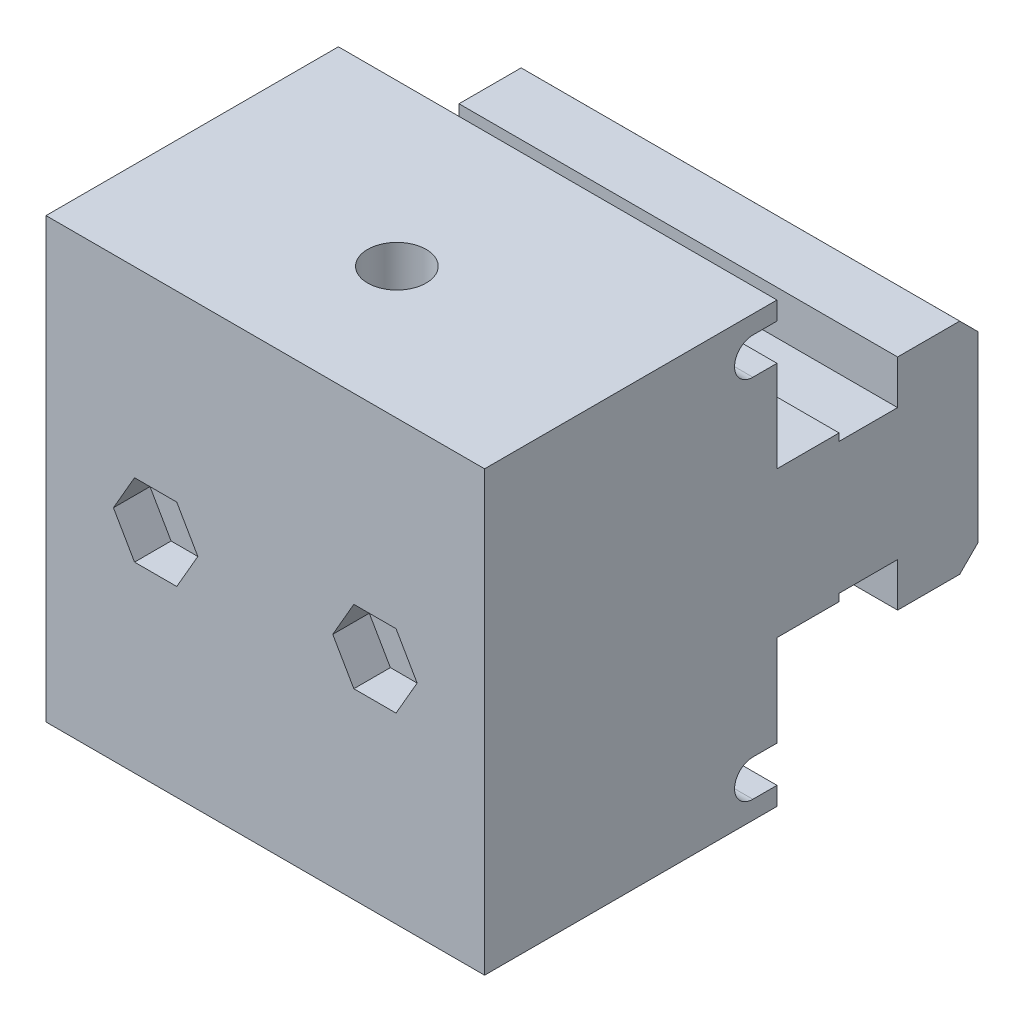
ISO-10303-21;
HEADER;
FILE_DESCRIPTION(('STEP AP214'),'2;1');
FILE_NAME('part.step','',(''),(''),'','','');
FILE_SCHEMA(('AUTOMOTIVE_DESIGN { 1 0 10303 214 1 1 1 1 }'));
ENDSEC;
DATA;
#1=APPLICATION_CONTEXT('core data for automotive mechanical design processes');
#2=APPLICATION_PROTOCOL_DEFINITION('international standard','automotive_design',2000,#1);
#3=PRODUCT_CONTEXT('',#1,'mechanical');
#4=PRODUCT('Part','Part','',(#3));
#5=PRODUCT_RELATED_PRODUCT_CATEGORY('part','',(#4));
#6=PRODUCT_DEFINITION_FORMATION('','',#4);
#7=PRODUCT_DEFINITION_CONTEXT('part definition',#1,'design');
#8=PRODUCT_DEFINITION('design','',#6,#7);
#9=PRODUCT_DEFINITION_SHAPE('','',#8);
#10=(LENGTH_UNIT() NAMED_UNIT(*) SI_UNIT(.MILLI.,.METRE.));
#11=(NAMED_UNIT(*) PLANE_ANGLE_UNIT() SI_UNIT($,.RADIAN.));
#12=(NAMED_UNIT(*) SI_UNIT($,.STERADIAN.) SOLID_ANGLE_UNIT());
#13=UNCERTAINTY_MEASURE_WITH_UNIT(LENGTH_MEASURE(1.E-05),#10,'distance_accuracy_value','');
#14=(GEOMETRIC_REPRESENTATION_CONTEXT(3) GLOBAL_UNCERTAINTY_ASSIGNED_CONTEXT((#13)) GLOBAL_UNIT_ASSIGNED_CONTEXT((#10,
#11,#12)) REPRESENTATION_CONTEXT('',''));
#15=CARTESIAN_POINT('',(0.,0.,0.));
#16=DIRECTION('',(0.,0.,1.));
#17=DIRECTION('',(1.,0.,0.));
#18=AXIS2_PLACEMENT_3D('',#15,#16,#17);
#19=CARTESIAN_POINT('',(60.,9.99922625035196,0.));
#20=DIRECTION('',(0.,0.,1.));
#21=DIRECTION('',(0.,-1.,0.));
#22=AXIS2_PLACEMENT_3D('',#19,#20,#21);
#23=PLANE('',#22);
#24=DIRECTION('',(0.,1.,0.));
#25=VECTOR('',#24,1.);
#26=CARTESIAN_POINT('',(60.,9.99922625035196,0.));
#27=LINE('',#26,#25);
#28=CARTESIAN_POINT('',(60.,27.4990625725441,0.));
#29=VERTEX_POINT('',#28);
#30=CARTESIAN_POINT('',(60.,30.0000595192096,0.));
#31=VERTEX_POINT('',#30);
#32=EDGE_CURVE('E495',#29,#31,#27,.T.);
#33=ORIENTED_EDGE('',*,*,#32,.F.);
#34=DIRECTION('',(1.,0.,0.));
#35=VECTOR('',#34,1.);
#36=CARTESIAN_POINT('',(0.,27.4990625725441,0.));
#37=LINE('',#36,#35);
#38=CARTESIAN_POINT('',(0.,27.4990625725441,0.));
#39=VERTEX_POINT('',#38);
#40=EDGE_CURVE('E291',#39,#29,#37,.T.);
#41=ORIENTED_EDGE('',*,*,#40,.F.);
#42=DIRECTION('',(0.,1.,0.));
#43=VECTOR('',#42,1.);
#44=CARTESIAN_POINT('',(0.,9.99922625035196,0.));
#45=LINE('',#44,#43);
#46=CARTESIAN_POINT('',(0.,30.0000595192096,0.));
#47=VERTEX_POINT('',#46);
#48=EDGE_CURVE('E455',#39,#47,#45,.T.);
#49=ORIENTED_EDGE('',*,*,#48,.T.);
#50=DIRECTION('',(-1.,0.,0.));
#51=VECTOR('',#50,1.);
#52=CARTESIAN_POINT('',(60.,30.0000595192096,0.));
#53=LINE('',#52,#51);
#54=EDGE_CURVE('E512',#31,#47,#53,.T.);
#55=ORIENTED_EDGE('',*,*,#54,.F.);
#56=EDGE_LOOP('',(#33,#41,#49,#55));
#57=FACE_BOUND('',#56,.T.);
#58=ADVANCED_FACE('F14',(#57),#23,.F.);
#59=CARTESIAN_POINT('',(60.,-30.0000595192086,0.));
#60=DIRECTION('',(0.,0.,1.));
#61=DIRECTION('',(1.,0.,0.));
#62=AXIS2_PLACEMENT_3D('',#59,#60,#61);
#63=PLANE('',#62);
#64=DIRECTION('',(0.,1.,0.));
#65=VECTOR('',#64,1.);
#66=CARTESIAN_POINT('',(60.,-30.0000595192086,0.));
#67=LINE('',#66,#65);
#68=CARTESIAN_POINT('',(60.,-22.5006398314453,0.));
#69=VERTEX_POINT('',#68);
#70=CARTESIAN_POINT('',(60.,-10.0004166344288,0.));
#71=VERTEX_POINT('',#70);
#72=EDGE_CURVE('E465',#69,#71,#67,.T.);
#73=ORIENTED_EDGE('',*,*,#72,.F.);
#74=DIRECTION('',(1.,0.,0.));
#75=VECTOR('',#74,1.);
#76=CARTESIAN_POINT('',(0.,-22.5006398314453,0.));
#77=LINE('',#76,#75);
#78=CARTESIAN_POINT('',(0.,-22.5006398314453,0.));
#79=VERTEX_POINT('',#78);
#80=EDGE_CURVE('E309',#79,#69,#77,.T.);
#81=ORIENTED_EDGE('',*,*,#80,.F.);
#82=DIRECTION('',(0.,1.,0.));
#83=VECTOR('',#82,1.);
#84=CARTESIAN_POINT('',(0.,-30.0000595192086,0.));
#85=LINE('',#84,#83);
#86=CARTESIAN_POINT('',(0.,-10.0004166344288,0.));
#87=VERTEX_POINT('',#86);
#88=EDGE_CURVE('E415',#79,#87,#85,.T.);
#89=ORIENTED_EDGE('',*,*,#88,.T.);
#90=DIRECTION('',(-1.,0.,0.));
#91=VECTOR('',#90,1.);
#92=CARTESIAN_POINT('',(60.,-10.0004166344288,0.));
#93=LINE('',#92,#91);
#94=EDGE_CURVE('E9',#71,#87,#93,.T.);
#95=ORIENTED_EDGE('',*,*,#94,.F.);
#96=EDGE_LOOP('',(#73,#81,#89,#95));
#97=FACE_BOUND('',#96,.T.);
#98=ADVANCED_FACE('F582',(#97),#63,.F.);
#99=CARTESIAN_POINT('',(0.,-30.0000595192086,0.));
#100=VERTEX_POINT('',#99);
#101=CARTESIAN_POINT('',(0.,-27.5002529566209,0.));
#102=VERTEX_POINT('',#101);
#103=EDGE_CURVE('E426',#100,#102,#85,.T.);
#104=ORIENTED_EDGE('',*,*,#103,.T.);
#105=DIRECTION('',(1.,0.,0.));
#106=VECTOR('',#105,1.);
#107=CARTESIAN_POINT('',(0.,-27.5002529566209,0.));
#108=LINE('',#107,#106);
#109=CARTESIAN_POINT('',(60.,-27.5002529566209,0.));
#110=VERTEX_POINT('',#109);
#111=EDGE_CURVE('E312',#102,#110,#108,.T.);
#112=ORIENTED_EDGE('',*,*,#111,.T.);
#113=CARTESIAN_POINT('',(60.,-30.0000595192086,0.));
#114=VERTEX_POINT('',#113);
#115=EDGE_CURVE('E466',#114,#110,#67,.T.);
#116=ORIENTED_EDGE('',*,*,#115,.F.);
#117=DIRECTION('',(-1.,0.,0.));
#118=VECTOR('',#117,1.);
#119=CARTESIAN_POINT('',(60.,-30.0000595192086,0.));
#120=LINE('',#119,#118);
#121=EDGE_CURVE('E503',#114,#100,#120,.T.);
#122=ORIENTED_EDGE('',*,*,#121,.T.);
#123=EDGE_LOOP('',(#104,#112,#116,#122));
#124=FACE_BOUND('',#123,.T.);
#125=ADVANCED_FACE('F16',(#124),#63,.F.);
#126=CARTESIAN_POINT('',(60.,-10.0004166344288,-8.49934231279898));
#127=DIRECTION('',(0.,1.,0.));
#128=DIRECTION('',(-1.,0.,0.));
#129=AXIS2_PLACEMENT_3D('',#126,#127,#128);
#130=PLANE('',#129);
#131=DIRECTION('',(0.,0.,-1.));
#132=VECTOR('',#131,1.);
#133=CARTESIAN_POINT('',(0.,-10.0004166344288,-8.49934231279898));
#134=LINE('',#133,#132);
#135=CARTESIAN_POINT('',(0.,-10.0004166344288,-8.49934231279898));
#136=VERTEX_POINT('',#135);
#137=EDGE_CURVE('E429',#87,#136,#134,.T.);
#138=ORIENTED_EDGE('',*,*,#137,.T.);
#139=DIRECTION('',(-1.,0.,0.));
#140=VECTOR('',#139,1.);
#141=CARTESIAN_POINT('',(60.,-10.0004166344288,-8.49934231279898));
#142=LINE('',#141,#140);
#143=CARTESIAN_POINT('',(60.,-10.0004166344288,-8.49934231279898));
#144=VERTEX_POINT('',#143);
#145=EDGE_CURVE('E22',#144,#136,#142,.T.);
#146=ORIENTED_EDGE('',*,*,#145,.F.);
#147=DIRECTION('',(0.,0.,-1.));
#148=VECTOR('',#147,1.);
#149=CARTESIAN_POINT('',(60.,-10.0004166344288,-8.49934231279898));
#150=LINE('',#149,#148);
#151=EDGE_CURVE('E469',#71,#144,#150,.T.);
#152=ORIENTED_EDGE('',*,*,#151,.F.);
#153=ORIENTED_EDGE('',*,*,#94,.T.);
#154=EDGE_LOOP('',(#138,#146,#152,#153));
#155=FACE_BOUND('',#154,.T.);
#156=ADVANCED_FACE('F580',(#155),#130,.F.);
#157=CARTESIAN_POINT('',(60.,-9.00049400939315,-8.49934231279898));
#158=DIRECTION('',(0.,0.,1.));
#159=DIRECTION('',(1.,0.,0.));
#160=AXIS2_PLACEMENT_3D('',#157,#158,#159);
#161=PLANE('',#160);
#162=DIRECTION('',(0.,1.,0.));
#163=VECTOR('',#162,1.);
#164=CARTESIAN_POINT('',(0.,-9.00049400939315,-8.49934231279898));
#165=LINE('',#164,#163);
#166=CARTESIAN_POINT('',(0.,-9.00049400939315,-8.49934231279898));
#167=VERTEX_POINT('',#166);
#168=EDGE_CURVE('E431',#136,#167,#165,.T.);
#169=ORIENTED_EDGE('',*,*,#168,.T.);
#170=DIRECTION('',(-1.,0.,0.));
#171=VECTOR('',#170,1.);
#172=CARTESIAN_POINT('',(60.,-9.00049400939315,-8.49934231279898));
#173=LINE('',#172,#171);
#174=CARTESIAN_POINT('',(60.,-9.00049400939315,-8.49934231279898));
#175=VERTEX_POINT('',#174);
#176=EDGE_CURVE('E548',#175,#167,#173,.T.);
#177=ORIENTED_EDGE('',*,*,#176,.F.);
#178=DIRECTION('',(0.,1.,0.));
#179=VECTOR('',#178,1.);
#180=CARTESIAN_POINT('',(60.,-9.00049400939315,-8.49934231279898));
#181=LINE('',#180,#179);
#182=EDGE_CURVE('E471',#144,#175,#181,.T.);
#183=ORIENTED_EDGE('',*,*,#182,.F.);
#184=ORIENTED_EDGE('',*,*,#145,.T.);
#185=EDGE_LOOP('',(#169,#177,#183,#184));
#186=FACE_BOUND('',#185,.T.);
#187=ADVANCED_FACE('F555',(#186),#161,.F.);
#188=CARTESIAN_POINT('',(60.,-9.00049400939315,-8.49934231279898));
#189=DIRECTION('',(0.,1.,0.));
#190=DIRECTION('',(-1.,0.,0.));
#191=AXIS2_PLACEMENT_3D('',#188,#189,#190);
#192=PLANE('',#191);
#193=DIRECTION('',(0.,0.,-1.));
#194=VECTOR('',#193,1.);
#195=CARTESIAN_POINT('',(0.,-9.00049400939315,-8.49934231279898));
#196=LINE('',#195,#194);
#197=CARTESIAN_POINT('',(0.,-9.00049400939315,-16.4999136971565));
#198=VERTEX_POINT('',#197);
#199=EDGE_CURVE('E433',#167,#198,#196,.T.);
#200=ORIENTED_EDGE('',*,*,#199,.T.);
#201=DIRECTION('',(-1.,0.,0.));
#202=VECTOR('',#201,1.);
#203=CARTESIAN_POINT('',(60.,-9.00049400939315,-16.4999136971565));
#204=LINE('',#203,#202);
#205=CARTESIAN_POINT('',(60.,-9.00049400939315,-16.4999136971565));
#206=VERTEX_POINT('',#205);
#207=EDGE_CURVE('E545',#206,#198,#204,.T.);
#208=ORIENTED_EDGE('',*,*,#207,.F.);
#209=DIRECTION('',(0.,0.,-1.));
#210=VECTOR('',#209,1.);
#211=CARTESIAN_POINT('',(60.,-9.00049400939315,-8.49934231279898));
#212=LINE('',#211,#210);
#213=EDGE_CURVE('E473',#175,#206,#212,.T.);
#214=ORIENTED_EDGE('',*,*,#213,.F.);
#215=ORIENTED_EDGE('',*,*,#176,.T.);
#216=EDGE_LOOP('',(#200,#208,#214,#215));
#217=FACE_BOUND('',#216,.T.);
#218=ADVANCED_FACE('F569',(#217),#192,.F.);
#219=CARTESIAN_POINT('',(60.,-15.0000297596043,-16.4999136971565));
#220=DIRECTION('',(0.,0.,-1.));
#221=DIRECTION('',(-1.,0.,0.));
#222=AXIS2_PLACEMENT_3D('',#219,#220,#221);
#223=PLANE('',#222);
#224=DIRECTION('',(0.,-1.,0.));
#225=VECTOR('',#224,1.);
#226=CARTESIAN_POINT('',(0.,-15.0000297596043,-16.4999136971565));
#227=LINE('',#226,#225);
#228=CARTESIAN_POINT('',(0.,-15.0000297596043,-16.4999136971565));
#229=VERTEX_POINT('',#228);
#230=EDGE_CURVE('E435',#198,#229,#227,.T.);
#231=ORIENTED_EDGE('',*,*,#230,.T.);
#232=DIRECTION('',(-1.,0.,0.));
#233=VECTOR('',#232,1.);
#234=CARTESIAN_POINT('',(60.,-15.0000297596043,-16.4999136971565));
#235=LINE('',#234,#233);
#236=CARTESIAN_POINT('',(60.,-15.0000297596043,-16.4999136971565));
#237=VERTEX_POINT('',#236);
#238=EDGE_CURVE('E542',#237,#229,#235,.T.);
#239=ORIENTED_EDGE('',*,*,#238,.F.);
#240=DIRECTION('',(0.,-1.,0.));
#241=VECTOR('',#240,1.);
#242=CARTESIAN_POINT('',(60.,-15.0000297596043,-16.4999136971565));
#243=LINE('',#242,#241);
#244=EDGE_CURVE('E475',#206,#237,#243,.T.);
#245=ORIENTED_EDGE('',*,*,#244,.F.);
#246=ORIENTED_EDGE('',*,*,#207,.T.);
#247=EDGE_LOOP('',(#231,#239,#245,#246));
#248=FACE_BOUND('',#247,.T.);
#249=ADVANCED_FACE('F573',(#248),#223,.F.);
#250=CARTESIAN_POINT('',(60.,-15.0000297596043,-24.9992560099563));
#251=DIRECTION('',(0.,1.,0.));
#252=DIRECTION('',(-1.,0.,0.));
#253=AXIS2_PLACEMENT_3D('',#250,#251,#252);
#254=PLANE('',#253);
#255=DIRECTION('',(0.,0.,-1.));
#256=VECTOR('',#255,1.);
#257=CARTESIAN_POINT('',(0.,-15.0000297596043,-24.9992560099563));
#258=LINE('',#257,#256);
#259=CARTESIAN_POINT('',(0.,-15.0000297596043,-24.9992560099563));
#260=VERTEX_POINT('',#259);
#261=EDGE_CURVE('E437',#229,#260,#258,.T.);
#262=ORIENTED_EDGE('',*,*,#261,.T.);
#263=DIRECTION('',(-1.,0.,0.));
#264=VECTOR('',#263,1.);
#265=CARTESIAN_POINT('',(60.,-15.0000297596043,-24.9992560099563));
#266=LINE('',#265,#264);
#267=CARTESIAN_POINT('',(60.,-15.0000297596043,-24.9992560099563));
#268=VERTEX_POINT('',#267);
#269=EDGE_CURVE('E539',#268,#260,#266,.T.);
#270=ORIENTED_EDGE('',*,*,#269,.F.);
#271=DIRECTION('',(0.,0.,-1.));
#272=VECTOR('',#271,1.);
#273=CARTESIAN_POINT('',(60.,-15.0000297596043,-24.9992560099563));
#274=LINE('',#273,#272);
#275=EDGE_CURVE('E477',#237,#268,#274,.T.);
#276=ORIENTED_EDGE('',*,*,#275,.F.);
#277=ORIENTED_EDGE('',*,*,#238,.T.);
#278=EDGE_LOOP('',(#262,#270,#276,#277));
#279=FACE_BOUND('',#278,.T.);
#280=ADVANCED_FACE('F685',(#279),#254,.F.);
#281=CARTESIAN_POINT('',(60.,-12.5002231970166,-27.500252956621));
#282=DIRECTION('',(0.,0.707275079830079,0.706938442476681));
#283=DIRECTION('',(0.,-0.706938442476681,0.707275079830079));
#284=AXIS2_PLACEMENT_3D('',#281,#282,#283);
#285=PLANE('',#284);
#286=DIRECTION('',(0.,0.706938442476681,-0.707275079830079));
#287=VECTOR('',#286,1.);
#288=CARTESIAN_POINT('',(0.,-12.5002231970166,-27.500252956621));
#289=LINE('',#288,#287);
#290=CARTESIAN_POINT('',(0.,-12.5002231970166,-27.500252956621));
#291=VERTEX_POINT('',#290);
#292=EDGE_CURVE('E439',#260,#291,#289,.T.);
#293=ORIENTED_EDGE('',*,*,#292,.T.);
#294=DIRECTION('',(-1.,0.,0.));
#295=VECTOR('',#294,1.);
#296=CARTESIAN_POINT('',(60.,-12.5002231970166,-27.500252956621));
#297=LINE('',#296,#295);
#298=CARTESIAN_POINT('',(60.,-12.5002231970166,-27.500252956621));
#299=VERTEX_POINT('',#298);
#300=EDGE_CURVE('E536',#299,#291,#297,.T.);
#301=ORIENTED_EDGE('',*,*,#300,.F.);
#302=DIRECTION('',(0.,0.706938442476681,-0.707275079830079));
#303=VECTOR('',#302,1.);
#304=CARTESIAN_POINT('',(60.,-12.5002231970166,-27.500252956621));
#305=LINE('',#304,#303);
#306=EDGE_CURVE('E479',#268,#299,#305,.T.);
#307=ORIENTED_EDGE('',*,*,#306,.F.);
#308=ORIENTED_EDGE('',*,*,#269,.T.);
#309=EDGE_LOOP('',(#293,#301,#307,#308));
#310=FACE_BOUND('',#309,.T.);
#311=ADVANCED_FACE('F683',(#310),#285,.F.);
#312=CARTESIAN_POINT('',(60.,12.5002231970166,-27.500252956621));
#313=DIRECTION('',(0.,0.,1.));
#314=DIRECTION('',(1.,0.,0.));
#315=AXIS2_PLACEMENT_3D('',#312,#313,#314);
#316=PLANE('',#315);
#317=DIRECTION('',(0.,1.,0.));
#318=VECTOR('',#317,1.);
#319=CARTESIAN_POINT('',(0.,12.5002231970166,-27.500252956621));
#320=LINE('',#319,#318);
#321=CARTESIAN_POINT('',(0.,12.5002231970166,-27.500252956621));
#322=VERTEX_POINT('',#321);
#323=EDGE_CURVE('E441',#291,#322,#320,.T.);
#324=ORIENTED_EDGE('',*,*,#323,.T.);
#325=DIRECTION('',(-1.,0.,0.));
#326=VECTOR('',#325,1.);
#327=CARTESIAN_POINT('',(60.,12.5002231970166,-27.500252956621));
#328=LINE('',#327,#326);
#329=CARTESIAN_POINT('',(60.,12.5002231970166,-27.500252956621));
#330=VERTEX_POINT('',#329);
#331=EDGE_CURVE('E533',#330,#322,#328,.T.);
#332=ORIENTED_EDGE('',*,*,#331,.F.);
#333=DIRECTION('',(0.,1.,0.));
#334=VECTOR('',#333,1.);
#335=CARTESIAN_POINT('',(60.,12.5002231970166,-27.500252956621));
#336=LINE('',#335,#334);
#337=EDGE_CURVE('E481',#299,#330,#336,.T.);
#338=ORIENTED_EDGE('',*,*,#337,.F.);
#339=ORIENTED_EDGE('',*,*,#300,.T.);
#340=EDGE_LOOP('',(#324,#332,#338,#339));
#341=FACE_BOUND('',#340,.T.);
#342=ADVANCED_FACE('F678',(#341),#316,.F.);
#343=CARTESIAN_POINT('',(60.,15.0000297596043,-24.9992560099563));
#344=DIRECTION('',(0.,-0.707275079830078,0.706938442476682));
#345=DIRECTION('',(0.,-0.706938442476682,-0.707275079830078));
#346=AXIS2_PLACEMENT_3D('',#343,#344,#345);
#347=PLANE('',#346);
#348=DIRECTION('',(0.,0.706938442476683,0.707275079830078));
#349=VECTOR('',#348,1.);
#350=CARTESIAN_POINT('',(0.,15.0000297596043,-24.9992560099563));
#351=LINE('',#350,#349);
#352=CARTESIAN_POINT('',(0.,15.0000297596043,-24.9992560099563));
#353=VERTEX_POINT('',#352);
#354=EDGE_CURVE('E443',#322,#353,#351,.T.);
#355=ORIENTED_EDGE('',*,*,#354,.T.);
#356=DIRECTION('',(-1.,0.,0.));
#357=VECTOR('',#356,1.);
#358=CARTESIAN_POINT('',(60.,15.0000297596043,-24.9992560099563));
#359=LINE('',#358,#357);
#360=CARTESIAN_POINT('',(60.,15.0000297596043,-24.9992560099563));
#361=VERTEX_POINT('',#360);
#362=EDGE_CURVE('E530',#361,#353,#359,.T.);
#363=ORIENTED_EDGE('',*,*,#362,.F.);
#364=DIRECTION('',(0.,0.706938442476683,0.707275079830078));
#365=VECTOR('',#364,1.);
#366=CARTESIAN_POINT('',(60.,15.0000297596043,-24.9992560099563));
#367=LINE('',#366,#365);
#368=EDGE_CURVE('E483',#330,#361,#367,.T.);
#369=ORIENTED_EDGE('',*,*,#368,.F.);
#370=ORIENTED_EDGE('',*,*,#331,.T.);
#371=EDGE_LOOP('',(#355,#363,#369,#370));
#372=FACE_BOUND('',#371,.T.);
#373=ADVANCED_FACE('F673',(#372),#347,.F.);
#374=CARTESIAN_POINT('',(60.,15.0000297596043,-16.4999136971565));
#375=DIRECTION('',(0.,-1.,0.));
#376=DIRECTION('',(1.,0.,0.));
#377=AXIS2_PLACEMENT_3D('',#374,#375,#376);
#378=PLANE('',#377);
#379=DIRECTION('',(0.,0.,1.));
#380=VECTOR('',#379,1.);
#381=CARTESIAN_POINT('',(0.,15.0000297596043,-16.4999136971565));
#382=LINE('',#381,#380);
#383=CARTESIAN_POINT('',(0.,15.0000297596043,-16.4999136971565));
#384=VERTEX_POINT('',#383);
#385=EDGE_CURVE('E445',#353,#384,#382,.T.);
#386=ORIENTED_EDGE('',*,*,#385,.T.);
#387=DIRECTION('',(-1.,0.,0.));
#388=VECTOR('',#387,1.);
#389=CARTESIAN_POINT('',(60.,15.0000297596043,-16.4999136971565));
#390=LINE('',#389,#388);
#391=CARTESIAN_POINT('',(60.,15.0000297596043,-16.4999136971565));
#392=VERTEX_POINT('',#391);
#393=EDGE_CURVE('E527',#392,#384,#390,.T.);
#394=ORIENTED_EDGE('',*,*,#393,.F.);
#395=DIRECTION('',(0.,0.,1.));
#396=VECTOR('',#395,1.);
#397=CARTESIAN_POINT('',(60.,15.0000297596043,-16.4999136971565));
#398=LINE('',#397,#396);
#399=EDGE_CURVE('E485',#361,#392,#398,.T.);
#400=ORIENTED_EDGE('',*,*,#399,.F.);
#401=ORIENTED_EDGE('',*,*,#362,.T.);
#402=EDGE_LOOP('',(#386,#394,#400,#401));
#403=FACE_BOUND('',#402,.T.);
#404=ADVANCED_FACE('F669',(#403),#378,.F.);
#405=CARTESIAN_POINT('',(60.,8.99930362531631,-16.4999136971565));
#406=DIRECTION('',(0.,0.,-1.));
#407=DIRECTION('',(-1.,0.,0.));
#408=AXIS2_PLACEMENT_3D('',#405,#406,#407);
#409=PLANE('',#408);
#410=DIRECTION('',(0.,-1.,0.));
#411=VECTOR('',#410,1.);
#412=CARTESIAN_POINT('',(0.,8.99930362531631,-16.4999136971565));
#413=LINE('',#412,#411);
#414=CARTESIAN_POINT('',(0.,8.99930362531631,-16.4999136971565));
#415=VERTEX_POINT('',#414);
#416=EDGE_CURVE('E447',#384,#415,#413,.T.);
#417=ORIENTED_EDGE('',*,*,#416,.T.);
#418=DIRECTION('',(-1.,0.,0.));
#419=VECTOR('',#418,1.);
#420=CARTESIAN_POINT('',(60.,8.99930362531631,-16.4999136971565));
#421=LINE('',#420,#419);
#422=CARTESIAN_POINT('',(60.,8.99930362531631,-16.4999136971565));
#423=VERTEX_POINT('',#422);
#424=EDGE_CURVE('E524',#423,#415,#421,.T.);
#425=ORIENTED_EDGE('',*,*,#424,.F.);
#426=DIRECTION('',(0.,-1.,0.));
#427=VECTOR('',#426,1.);
#428=CARTESIAN_POINT('',(60.,8.99930362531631,-16.4999136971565));
#429=LINE('',#428,#427);
#430=EDGE_CURVE('E487',#392,#423,#429,.T.);
#431=ORIENTED_EDGE('',*,*,#430,.F.);
#432=ORIENTED_EDGE('',*,*,#393,.T.);
#433=EDGE_LOOP('',(#417,#425,#431,#432));
#434=FACE_BOUND('',#433,.T.);
#435=ADVANCED_FACE('F664',(#434),#409,.F.);
#436=CARTESIAN_POINT('',(60.,8.99930362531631,-16.4999136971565));
#437=DIRECTION('',(0.,-1.,0.));
#438=DIRECTION('',(1.,0.,0.));
#439=AXIS2_PLACEMENT_3D('',#436,#437,#438);
#440=PLANE('',#439);
#441=DIRECTION('',(0.,0.,1.));
#442=VECTOR('',#441,1.);
#443=CARTESIAN_POINT('',(0.,8.99930362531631,-16.4999136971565));
#444=LINE('',#443,#442);
#445=CARTESIAN_POINT('',(0.,8.99930362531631,-8.49934231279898));
#446=VERTEX_POINT('',#445);
#447=EDGE_CURVE('E449',#415,#446,#444,.T.);
#448=ORIENTED_EDGE('',*,*,#447,.T.);
#449=DIRECTION('',(-1.,0.,0.));
#450=VECTOR('',#449,1.);
#451=CARTESIAN_POINT('',(60.,8.99930362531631,-8.49934231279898));
#452=LINE('',#451,#450);
#453=CARTESIAN_POINT('',(60.,8.99930362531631,-8.49934231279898));
#454=VERTEX_POINT('',#453);
#455=EDGE_CURVE('E521',#454,#446,#452,.T.);
#456=ORIENTED_EDGE('',*,*,#455,.F.);
#457=DIRECTION('',(0.,0.,1.));
#458=VECTOR('',#457,1.);
#459=CARTESIAN_POINT('',(60.,8.99930362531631,-16.4999136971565));
#460=LINE('',#459,#458);
#461=EDGE_CURVE('E489',#423,#454,#460,.T.);
#462=ORIENTED_EDGE('',*,*,#461,.F.);
#463=ORIENTED_EDGE('',*,*,#424,.T.);
#464=EDGE_LOOP('',(#448,#456,#462,#463));
#465=FACE_BOUND('',#464,.T.);
#466=ADVANCED_FACE('F658',(#465),#440,.F.);
#467=CARTESIAN_POINT('',(60.,9.99922625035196,-8.49934231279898));
#468=DIRECTION('',(0.,0.,1.));
#469=DIRECTION('',(1.,0.,0.));
#470=AXIS2_PLACEMENT_3D('',#467,#468,#469);
#471=PLANE('',#470);
#472=DIRECTION('',(0.,1.,0.));
#473=VECTOR('',#472,1.);
#474=CARTESIAN_POINT('',(0.,9.99922625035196,-8.49934231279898));
#475=LINE('',#474,#473);
#476=CARTESIAN_POINT('',(0.,9.99922625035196,-8.49934231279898));
#477=VERTEX_POINT('',#476);
#478=EDGE_CURVE('E451',#446,#477,#475,.T.);
#479=ORIENTED_EDGE('',*,*,#478,.T.);
#480=DIRECTION('',(-1.,0.,0.));
#481=VECTOR('',#480,1.);
#482=CARTESIAN_POINT('',(60.,9.99922625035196,-8.49934231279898));
#483=LINE('',#482,#481);
#484=CARTESIAN_POINT('',(60.,9.99922625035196,-8.49934231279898));
#485=VERTEX_POINT('',#484);
#486=EDGE_CURVE('E518',#485,#477,#483,.T.);
#487=ORIENTED_EDGE('',*,*,#486,.F.);
#488=DIRECTION('',(0.,1.,0.));
#489=VECTOR('',#488,1.);
#490=CARTESIAN_POINT('',(60.,9.99922625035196,-8.49934231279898));
#491=LINE('',#490,#489);
#492=EDGE_CURVE('E491',#454,#485,#491,.T.);
#493=ORIENTED_EDGE('',*,*,#492,.F.);
#494=ORIENTED_EDGE('',*,*,#455,.T.);
#495=EDGE_LOOP('',(#479,#487,#493,#494));
#496=FACE_BOUND('',#495,.T.);
#497=ADVANCED_FACE('F644',(#496),#471,.F.);
#498=CARTESIAN_POINT('',(60.,9.99922625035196,0.));
#499=DIRECTION('',(0.,-1.,0.));
#500=DIRECTION('',(1.,0.,0.));
#501=AXIS2_PLACEMENT_3D('',#498,#499,#500);
#502=PLANE('',#501);
#503=DIRECTION('',(0.,0.,1.));
#504=VECTOR('',#503,1.);
#505=CARTESIAN_POINT('',(0.,9.99922625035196,0.));
#506=LINE('',#505,#504);
#507=CARTESIAN_POINT('',(0.,9.99922625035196,0.));
#508=VERTEX_POINT('',#507);
#509=EDGE_CURVE('E453',#477,#508,#506,.T.);
#510=ORIENTED_EDGE('',*,*,#509,.T.);
#511=DIRECTION('',(-1.,0.,0.));
#512=VECTOR('',#511,1.);
#513=CARTESIAN_POINT('',(60.,9.99922625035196,0.));
#514=LINE('',#513,#512);
#515=CARTESIAN_POINT('',(60.,9.99922625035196,0.));
#516=VERTEX_POINT('',#515);
#517=EDGE_CURVE('E515',#516,#508,#514,.T.);
#518=ORIENTED_EDGE('',*,*,#517,.F.);
#519=DIRECTION('',(0.,0.,1.));
#520=VECTOR('',#519,1.);
#521=CARTESIAN_POINT('',(60.,9.99922625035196,0.));
#522=LINE('',#521,#520);
#523=EDGE_CURVE('E493',#485,#516,#522,.T.);
#524=ORIENTED_EDGE('',*,*,#523,.F.);
#525=ORIENTED_EDGE('',*,*,#486,.T.);
#526=EDGE_LOOP('',(#510,#518,#524,#525));
#527=FACE_BOUND('',#526,.T.);
#528=ADVANCED_FACE('F636',(#527),#502,.F.);
#529=CARTESIAN_POINT('',(0.,22.4994494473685,0.));
#530=VERTEX_POINT('',#529);
#531=EDGE_CURVE('E456',#508,#530,#45,.T.);
#532=ORIENTED_EDGE('',*,*,#531,.T.);
#533=DIRECTION('',(1.,0.,0.));
#534=VECTOR('',#533,1.);
#535=CARTESIAN_POINT('',(0.,22.4994494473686,0.));
#536=LINE('',#535,#534);
#537=CARTESIAN_POINT('',(60.,22.4994494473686,0.));
#538=VERTEX_POINT('',#537);
#539=EDGE_CURVE('E29',#530,#538,#536,.T.);
#540=ORIENTED_EDGE('',*,*,#539,.T.);
#541=EDGE_CURVE('E279',#516,#538,#27,.T.);
#542=ORIENTED_EDGE('',*,*,#541,.F.);
#543=ORIENTED_EDGE('',*,*,#517,.T.);
#544=EDGE_LOOP('',(#532,#540,#542,#543));
#545=FACE_BOUND('',#544,.T.);
#546=ADVANCED_FACE('F628',(#545),#23,.F.);
#547=CARTESIAN_POINT('',(60.,30.0000595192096,0.));
#548=DIRECTION('',(0.,-1.,0.));
#549=DIRECTION('',(1.,0.,0.));
#550=AXIS2_PLACEMENT_3D('',#547,#548,#549);
#551=PLANE('',#550);
#552=CARTESIAN_POINT('',(30.,30.0000595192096,22.));
#553=DIRECTION('',(0.,1.,0.));
#554=DIRECTION('',(-1.,0.,0.));
#555=AXIS2_PLACEMENT_3D('',#552,#553,#554);
#556=CIRCLE('',#555,4.);
#557=CARTESIAN_POINT('',(26.,30.0000595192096,22.));
#558=VERTEX_POINT('',#557);
#559=EDGE_CURVE('E323',#558,#558,#556,.T.);
#560=ORIENTED_EDGE('',*,*,#559,.F.);
#561=EDGE_LOOP('',(#560));
#562=FACE_BOUND('',#561,.T.);
#563=DIRECTION('',(0.,0.,1.));
#564=VECTOR('',#563,1.);
#565=CARTESIAN_POINT('',(0.,30.0000595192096,0.));
#566=LINE('',#565,#564);
#567=CARTESIAN_POINT('',(0.,30.0000595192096,40.));
#568=VERTEX_POINT('',#567);
#569=EDGE_CURVE('E459',#47,#568,#566,.T.);
#570=ORIENTED_EDGE('',*,*,#569,.T.);
#571=DIRECTION('',(-1.,0.,0.));
#572=VECTOR('',#571,1.);
#573=CARTESIAN_POINT('',(60.,30.0000595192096,40.));
#574=LINE('',#573,#572);
#575=CARTESIAN_POINT('',(60.,30.0000595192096,40.));
#576=VERTEX_POINT('',#575);
#577=EDGE_CURVE('E509',#576,#568,#574,.T.);
#578=ORIENTED_EDGE('',*,*,#577,.F.);
#579=DIRECTION('',(0.,0.,1.));
#580=VECTOR('',#579,1.);
#581=CARTESIAN_POINT('',(60.,30.0000595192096,0.));
#582=LINE('',#581,#580);
#583=EDGE_CURVE('E497',#31,#576,#582,.T.);
#584=ORIENTED_EDGE('',*,*,#583,.F.);
#585=ORIENTED_EDGE('',*,*,#54,.T.);
#586=EDGE_LOOP('',(#570,#578,#584,#585));
#587=FACE_BOUND('',#586,.T.);
#588=ADVANCED_FACE('F609',(#562,#587),#551,.F.);
#589=CARTESIAN_POINT('',(60.,30.0000595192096,40.));
#590=DIRECTION('',(0.,0.,-1.));
#591=DIRECTION('',(-1.,0.,0.));
#592=AXIS2_PLACEMENT_3D('',#589,#590,#591);
#593=PLANE('',#592);
#594=DIRECTION('',(0.5,-0.866025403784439,0.));
#595=VECTOR('',#594,1.);
#596=CARTESIAN_POINT('',(39.2264973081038,0.,40.));
#597=LINE('',#596,#595);
#598=CARTESIAN_POINT('',(39.2264973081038,0.,40.));
#599=VERTEX_POINT('',#598);
#600=CARTESIAN_POINT('',(42.1132486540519,-5.,40.));
#601=VERTEX_POINT('',#600);
#602=EDGE_CURVE('E331',#599,#601,#597,.T.);
#603=ORIENTED_EDGE('',*,*,#602,.F.);
#604=DIRECTION('',(-0.5,-0.866025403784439,0.));
#605=VECTOR('',#604,1.);
#606=CARTESIAN_POINT('',(42.1132486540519,5.,40.));
#607=LINE('',#606,#605);
#608=CARTESIAN_POINT('',(42.1132486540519,5.,40.));
#609=VERTEX_POINT('',#608);
#610=EDGE_CURVE('E329',#609,#599,#607,.T.);
#611=ORIENTED_EDGE('',*,*,#610,.F.);
#612=DIRECTION('',(-1.,0.,0.));
#613=VECTOR('',#612,1.);
#614=CARTESIAN_POINT('',(47.8867513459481,5.,40.));
#615=LINE('',#614,#613);
#616=CARTESIAN_POINT('',(47.8867513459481,5.,40.));
#617=VERTEX_POINT('',#616);
#618=EDGE_CURVE('E343',#617,#609,#615,.T.);
#619=ORIENTED_EDGE('',*,*,#618,.F.);
#620=DIRECTION('',(-0.5,0.866025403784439,0.));
#621=VECTOR('',#620,1.);
#622=CARTESIAN_POINT('',(50.7735026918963,0.,40.));
#623=LINE('',#622,#621);
#624=CARTESIAN_POINT('',(50.7735026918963,0.,40.));
#625=VERTEX_POINT('',#624);
#626=EDGE_CURVE('E340',#625,#617,#623,.T.);
#627=ORIENTED_EDGE('',*,*,#626,.F.);
#628=DIRECTION('',(0.5,0.866025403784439,0.));
#629=VECTOR('',#628,1.);
#630=CARTESIAN_POINT('',(47.8867513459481,-5.,40.));
#631=LINE('',#630,#629);
#632=CARTESIAN_POINT('',(47.8867513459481,-5.,40.));
#633=VERTEX_POINT('',#632);
#634=EDGE_CURVE('E337',#633,#625,#631,.T.);
#635=ORIENTED_EDGE('',*,*,#634,.F.);
#636=DIRECTION('',(1.,0.,0.));
#637=VECTOR('',#636,1.);
#638=CARTESIAN_POINT('',(42.1132486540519,-5.,40.));
#639=LINE('',#638,#637);
#640=EDGE_CURVE('E334',#601,#633,#639,.T.);
#641=ORIENTED_EDGE('',*,*,#640,.F.);
#642=EDGE_LOOP('',(#603,#611,#619,#627,#635,#641));
#643=FACE_BOUND('',#642,.T.);
#644=DIRECTION('',(0.5,-0.866025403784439,0.));
#645=VECTOR('',#644,1.);
#646=CARTESIAN_POINT('',(9.22649730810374,0.,40.));
#647=LINE('',#646,#645);
#648=CARTESIAN_POINT('',(9.22649730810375,0.,40.));
#649=VERTEX_POINT('',#648);
#650=CARTESIAN_POINT('',(12.1132486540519,-5.,40.));
#651=VERTEX_POINT('',#650);
#652=EDGE_CURVE('E379',#649,#651,#647,.T.);
#653=ORIENTED_EDGE('',*,*,#652,.F.);
#654=DIRECTION('',(-0.5,-0.866025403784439,0.));
#655=VECTOR('',#654,1.);
#656=CARTESIAN_POINT('',(12.1132486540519,5.,40.));
#657=LINE('',#656,#655);
#658=CARTESIAN_POINT('',(12.1132486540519,5.,40.));
#659=VERTEX_POINT('',#658);
#660=EDGE_CURVE('E367',#659,#649,#657,.T.);
#661=ORIENTED_EDGE('',*,*,#660,.F.);
#662=DIRECTION('',(-1.,0.,0.));
#663=VECTOR('',#662,1.);
#664=CARTESIAN_POINT('',(17.8867513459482,5.,40.));
#665=LINE('',#664,#663);
#666=CARTESIAN_POINT('',(17.8867513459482,5.,40.));
#667=VERTEX_POINT('',#666);
#668=EDGE_CURVE('E391',#667,#659,#665,.T.);
#669=ORIENTED_EDGE('',*,*,#668,.F.);
#670=DIRECTION('',(-0.5,0.866025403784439,0.));
#671=VECTOR('',#670,1.);
#672=CARTESIAN_POINT('',(20.7735026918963,0.,40.));
#673=LINE('',#672,#671);
#674=CARTESIAN_POINT('',(20.7735026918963,0.,40.));
#675=VERTEX_POINT('',#674);
#676=EDGE_CURVE('E388',#675,#667,#673,.T.);
#677=ORIENTED_EDGE('',*,*,#676,.F.);
#678=DIRECTION('',(0.5,0.866025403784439,0.));
#679=VECTOR('',#678,1.);
#680=CARTESIAN_POINT('',(17.8867513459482,-5.,40.));
#681=LINE('',#680,#679);
#682=CARTESIAN_POINT('',(17.8867513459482,-5.,40.));
#683=VERTEX_POINT('',#682);
#684=EDGE_CURVE('E385',#683,#675,#681,.T.);
#685=ORIENTED_EDGE('',*,*,#684,.F.);
#686=DIRECTION('',(1.,0.,0.));
#687=VECTOR('',#686,1.);
#688=CARTESIAN_POINT('',(12.1132486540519,-5.,40.));
#689=LINE('',#688,#687);
#690=EDGE_CURVE('E382',#651,#683,#689,.T.);
#691=ORIENTED_EDGE('',*,*,#690,.F.);
#692=EDGE_LOOP('',(#653,#661,#669,#677,#685,#691));
#693=FACE_BOUND('',#692,.T.);
#694=DIRECTION('',(0.,-1.,0.));
#695=VECTOR('',#694,1.);
#696=CARTESIAN_POINT('',(0.,30.0000595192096,40.));
#697=LINE('',#696,#695);
#698=CARTESIAN_POINT('',(0.,-30.0000595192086,40.));
#699=VERTEX_POINT('',#698);
#700=EDGE_CURVE('E461',#568,#699,#697,.T.);
#701=ORIENTED_EDGE('',*,*,#700,.T.);
#702=DIRECTION('',(-1.,0.,0.));
#703=VECTOR('',#702,1.);
#704=CARTESIAN_POINT('',(60.,-30.0000595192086,40.));
#705=LINE('',#704,#703);
#706=CARTESIAN_POINT('',(60.,-30.0000595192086,40.));
#707=VERTEX_POINT('',#706);
#708=EDGE_CURVE('E506',#707,#699,#705,.T.);
#709=ORIENTED_EDGE('',*,*,#708,.F.);
#710=DIRECTION('',(0.,-1.,0.));
#711=VECTOR('',#710,1.);
#712=CARTESIAN_POINT('',(60.,30.0000595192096,40.));
#713=LINE('',#712,#711);
#714=EDGE_CURVE('E499',#576,#707,#713,.T.);
#715=ORIENTED_EDGE('',*,*,#714,.F.);
#716=ORIENTED_EDGE('',*,*,#577,.T.);
#717=EDGE_LOOP('',(#701,#709,#715,#716));
#718=FACE_BOUND('',#717,.T.);
#719=ADVANCED_FACE('F605',(#643,#693,#718),#593,.F.);
#720=CARTESIAN_POINT('',(60.,-30.0000595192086,0.));
#721=DIRECTION('',(0.,1.,0.));
#722=DIRECTION('',(-1.,0.,0.));
#723=AXIS2_PLACEMENT_3D('',#720,#721,#722);
#724=PLANE('',#723);
#725=CARTESIAN_POINT('',(30.,-30.0000595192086,22.));
#726=DIRECTION('',(0.,-1.,0.));
#727=DIRECTION('',(1.,0.,0.));
#728=AXIS2_PLACEMENT_3D('',#725,#726,#727);
#729=CIRCLE('',#728,4.);
#730=CARTESIAN_POINT('',(34.,-30.0000595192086,22.));
#731=VERTEX_POINT('',#730);
#732=EDGE_CURVE('E311',#731,#731,#729,.T.);
#733=ORIENTED_EDGE('',*,*,#732,.F.);
#734=EDGE_LOOP('',(#733));
#735=FACE_BOUND('',#734,.T.);
#736=DIRECTION('',(0.,0.,-1.));
#737=VECTOR('',#736,1.);
#738=CARTESIAN_POINT('',(0.,-30.0000595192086,0.));
#739=LINE('',#738,#737);
#740=EDGE_CURVE('E463',#699,#100,#739,.T.);
#741=ORIENTED_EDGE('',*,*,#740,.T.);
#742=ORIENTED_EDGE('',*,*,#121,.F.);
#743=DIRECTION('',(0.,0.,-1.));
#744=VECTOR('',#743,1.);
#745=CARTESIAN_POINT('',(60.,-30.0000595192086,0.));
#746=LINE('',#745,#744);
#747=EDGE_CURVE('E501',#707,#114,#746,.T.);
#748=ORIENTED_EDGE('',*,*,#747,.F.);
#749=ORIENTED_EDGE('',*,*,#708,.T.);
#750=EDGE_LOOP('',(#741,#742,#748,#749));
#751=FACE_BOUND('',#750,.T.);
#752=ADVANCED_FACE('F600',(#735,#751),#724,.F.);
#753=CARTESIAN_POINT('',(60.,-10.0004166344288,0.));
#754=DIRECTION('',(1.,0.,0.));
#755=DIRECTION('',(0.,1.,0.));
#756=AXIS2_PLACEMENT_3D('',#753,#754,#755);
#757=PLANE('',#756);
#758=DIRECTION('',(0.,0.,1.));
#759=VECTOR('',#758,1.);
#760=CARTESIAN_POINT('',(60.,27.4990625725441,0.));
#761=LINE('',#760,#759);
#762=CARTESIAN_POINT('',(60.,27.4990625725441,3.2997446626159));
#763=VERTEX_POINT('',#762);
#764=EDGE_CURVE('E280',#29,#763,#761,.T.);
#765=ORIENTED_EDGE('',*,*,#764,.F.);
#766=ORIENTED_EDGE('',*,*,#32,.T.);
#767=ORIENTED_EDGE('',*,*,#583,.T.);
#768=ORIENTED_EDGE('',*,*,#714,.T.);
#769=ORIENTED_EDGE('',*,*,#747,.T.);
#770=ORIENTED_EDGE('',*,*,#115,.T.);
#771=DIRECTION('',(0.,0.,-1.));
#772=VECTOR('',#771,1.);
#773=CARTESIAN_POINT('',(60.,-27.5002529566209,0.));
#774=LINE('',#773,#772);
#775=CARTESIAN_POINT('',(60.,-27.5002529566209,3.2997446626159));
#776=VERTEX_POINT('',#775);
#777=EDGE_CURVE('E299',#776,#110,#774,.T.);
#778=ORIENTED_EDGE('',*,*,#777,.F.);
#779=CARTESIAN_POINT('',(60.,-25.0004463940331,3.2997446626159));
#780=DIRECTION('',(1.,0.,0.));
#781=DIRECTION('',(0.,1.,0.));
#782=AXIS2_PLACEMENT_3D('',#779,#780,#781);
#783=CIRCLE('',#782,2.49980656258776);
#784=CARTESIAN_POINT('',(60.,-22.5006398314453,3.2997446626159));
#785=VERTEX_POINT('',#784);
#786=EDGE_CURVE('E296',#785,#776,#783,.T.);
#787=ORIENTED_EDGE('',*,*,#786,.F.);
#788=DIRECTION('',(0.,0.,1.));
#789=VECTOR('',#788,1.);
#790=CARTESIAN_POINT('',(60.,-22.5006398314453,0.));
#791=LINE('',#790,#789);
#792=EDGE_CURVE('E290',#69,#785,#791,.T.);
#793=ORIENTED_EDGE('',*,*,#792,.F.);
#794=ORIENTED_EDGE('',*,*,#72,.T.);
#795=ORIENTED_EDGE('',*,*,#151,.T.);
#796=ORIENTED_EDGE('',*,*,#182,.T.);
#797=ORIENTED_EDGE('',*,*,#213,.T.);
#798=ORIENTED_EDGE('',*,*,#244,.T.);
#799=ORIENTED_EDGE('',*,*,#275,.T.);
#800=ORIENTED_EDGE('',*,*,#306,.T.);
#801=ORIENTED_EDGE('',*,*,#337,.T.);
#802=ORIENTED_EDGE('',*,*,#368,.T.);
#803=ORIENTED_EDGE('',*,*,#399,.T.);
#804=ORIENTED_EDGE('',*,*,#430,.T.);
#805=ORIENTED_EDGE('',*,*,#461,.T.);
#806=ORIENTED_EDGE('',*,*,#492,.T.);
#807=ORIENTED_EDGE('',*,*,#523,.T.);
#808=ORIENTED_EDGE('',*,*,#541,.T.);
#809=DIRECTION('',(0.,0.,-1.));
#810=VECTOR('',#809,1.);
#811=CARTESIAN_POINT('',(60.,22.4994494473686,0.));
#812=LINE('',#811,#810);
#813=CARTESIAN_POINT('',(60.,22.4994494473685,3.2997446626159));
#814=VERTEX_POINT('',#813);
#815=EDGE_CURVE('E261',#814,#538,#812,.T.);
#816=ORIENTED_EDGE('',*,*,#815,.F.);
#817=CARTESIAN_POINT('',(60.,24.9992560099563,3.2997446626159));
#818=DIRECTION('',(1.,0.,0.));
#819=DIRECTION('',(0.,1.,0.));
#820=AXIS2_PLACEMENT_3D('',#817,#818,#819);
#821=CIRCLE('',#820,2.49980656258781);
#822=EDGE_CURVE('E269',#763,#814,#821,.T.);
#823=ORIENTED_EDGE('',*,*,#822,.F.);
#824=EDGE_LOOP('',(#765,#766,#767,#768,#769,#770,#778,#787,#793,#794,#795,#796,#797,#798,#799,
#800,#801,#802,#803,#804,#805,#806,#807,#808,#816,#823));
#825=FACE_BOUND('',#824,.T.);
#826=ADVANCED_FACE('F277',(#825),#757,.T.);
#827=CARTESIAN_POINT('',(0.,-10.0004166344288,0.));
#828=DIRECTION('',(1.,0.,0.));
#829=DIRECTION('',(0.,1.,0.));
#830=AXIS2_PLACEMENT_3D('',#827,#828,#829);
#831=PLANE('',#830);
#832=ORIENTED_EDGE('',*,*,#48,.F.);
#833=DIRECTION('',(0.,0.,1.));
#834=VECTOR('',#833,1.);
#835=CARTESIAN_POINT('',(0.,27.4990625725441,0.));
#836=LINE('',#835,#834);
#837=CARTESIAN_POINT('',(0.,27.4990625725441,3.2997446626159));
#838=VERTEX_POINT('',#837);
#839=EDGE_CURVE('E266',#39,#838,#836,.T.);
#840=ORIENTED_EDGE('',*,*,#839,.T.);
#841=CARTESIAN_POINT('',(0.,24.9992560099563,3.2997446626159));
#842=DIRECTION('',(1.,0.,0.));
#843=DIRECTION('',(0.,1.,0.));
#844=AXIS2_PLACEMENT_3D('',#841,#842,#843);
#845=CIRCLE('',#844,2.49980656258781);
#846=CARTESIAN_POINT('',(0.,22.4994494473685,3.2997446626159));
#847=VERTEX_POINT('',#846);
#848=EDGE_CURVE('E282',#838,#847,#845,.T.);
#849=ORIENTED_EDGE('',*,*,#848,.T.);
#850=DIRECTION('',(0.,0.,-1.));
#851=VECTOR('',#850,1.);
#852=CARTESIAN_POINT('',(0.,22.4994494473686,0.));
#853=LINE('',#852,#851);
#854=EDGE_CURVE('E262',#847,#530,#853,.T.);
#855=ORIENTED_EDGE('',*,*,#854,.T.);
#856=ORIENTED_EDGE('',*,*,#531,.F.);
#857=ORIENTED_EDGE('',*,*,#509,.F.);
#858=ORIENTED_EDGE('',*,*,#478,.F.);
#859=ORIENTED_EDGE('',*,*,#447,.F.);
#860=ORIENTED_EDGE('',*,*,#416,.F.);
#861=ORIENTED_EDGE('',*,*,#385,.F.);
#862=ORIENTED_EDGE('',*,*,#354,.F.);
#863=ORIENTED_EDGE('',*,*,#323,.F.);
#864=ORIENTED_EDGE('',*,*,#292,.F.);
#865=ORIENTED_EDGE('',*,*,#261,.F.);
#866=ORIENTED_EDGE('',*,*,#230,.F.);
#867=ORIENTED_EDGE('',*,*,#199,.F.);
#868=ORIENTED_EDGE('',*,*,#168,.F.);
#869=ORIENTED_EDGE('',*,*,#137,.F.);
#870=ORIENTED_EDGE('',*,*,#88,.F.);
#871=DIRECTION('',(0.,0.,1.));
#872=VECTOR('',#871,1.);
#873=CARTESIAN_POINT('',(0.,-22.5006398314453,0.));
#874=LINE('',#873,#872);
#875=CARTESIAN_POINT('',(0.,-22.5006398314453,3.2997446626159));
#876=VERTEX_POINT('',#875);
#877=EDGE_CURVE('E301',#79,#876,#874,.T.);
#878=ORIENTED_EDGE('',*,*,#877,.T.);
#879=CARTESIAN_POINT('',(0.,-25.0004463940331,3.2997446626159));
#880=DIRECTION('',(1.,0.,0.));
#881=DIRECTION('',(0.,1.,0.));
#882=AXIS2_PLACEMENT_3D('',#879,#880,#881);
#883=CIRCLE('',#882,2.49980656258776);
#884=CARTESIAN_POINT('',(0.,-27.5002529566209,3.2997446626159));
#885=VERTEX_POINT('',#884);
#886=EDGE_CURVE('E304',#876,#885,#883,.T.);
#887=ORIENTED_EDGE('',*,*,#886,.T.);
#888=DIRECTION('',(0.,0.,-1.));
#889=VECTOR('',#888,1.);
#890=CARTESIAN_POINT('',(0.,-27.5002529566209,0.));
#891=LINE('',#890,#889);
#892=EDGE_CURVE('E37',#885,#102,#891,.T.);
#893=ORIENTED_EDGE('',*,*,#892,.T.);
#894=ORIENTED_EDGE('',*,*,#103,.F.);
#895=ORIENTED_EDGE('',*,*,#740,.F.);
#896=ORIENTED_EDGE('',*,*,#700,.F.);
#897=ORIENTED_EDGE('',*,*,#569,.F.);
#898=EDGE_LOOP('',(#832,#840,#849,#855,#856,#857,#858,#859,#860,#861,#862,#863,#864,#865,#866,
#867,#868,#869,#870,#878,#887,#893,#894,#895,#896,#897));
#899=FACE_BOUND('',#898,.T.);
#900=ADVANCED_FACE('F563',(#899),#831,.F.);
#901=CARTESIAN_POINT('',(12.1132486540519,5.,35.));
#902=DIRECTION('',(-0.866025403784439,0.5,0.));
#903=DIRECTION('',(-0.5,-0.866025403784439,0.));
#904=AXIS2_PLACEMENT_3D('',#901,#902,#903);
#905=PLANE('',#904);
#906=ORIENTED_EDGE('',*,*,#660,.T.);
#907=DIRECTION('',(0.,0.,1.));
#908=VECTOR('',#907,1.);
#909=CARTESIAN_POINT('',(9.22649730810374,0.,35.));
#910=LINE('',#909,#908);
#911=CARTESIAN_POINT('',(9.22649730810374,0.,35.));
#912=VERTEX_POINT('',#911);
#913=EDGE_CURVE('E412',#912,#649,#910,.T.);
#914=ORIENTED_EDGE('',*,*,#913,.F.);
#915=DIRECTION('',(-0.5,-0.866025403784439,0.));
#916=VECTOR('',#915,1.);
#917=CARTESIAN_POINT('',(12.1132486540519,5.,35.));
#918=LINE('',#917,#916);
#919=CARTESIAN_POINT('',(12.1132486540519,5.,35.));
#920=VERTEX_POINT('',#919);
#921=EDGE_CURVE('E394',#920,#912,#918,.T.);
#922=ORIENTED_EDGE('',*,*,#921,.F.);
#923=DIRECTION('',(0.,0.,1.));
#924=VECTOR('',#923,1.);
#925=CARTESIAN_POINT('',(12.1132486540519,5.,35.));
#926=LINE('',#925,#924);
#927=EDGE_CURVE('E413',#920,#659,#926,.T.);
#928=ORIENTED_EDGE('',*,*,#927,.T.);
#929=EDGE_LOOP('',(#906,#914,#922,#928));
#930=FACE_BOUND('',#929,.T.);
#931=ADVANCED_FACE('F845',(#930),#905,.F.);
#932=CARTESIAN_POINT('',(17.8867513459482,5.,35.));
#933=DIRECTION('',(0.,1.,0.));
#934=DIRECTION('',(-1.,0.,0.));
#935=AXIS2_PLACEMENT_3D('',#932,#933,#934);
#936=PLANE('',#935);
#937=ORIENTED_EDGE('',*,*,#668,.T.);
#938=ORIENTED_EDGE('',*,*,#927,.F.);
#939=DIRECTION('',(-1.,0.,0.));
#940=VECTOR('',#939,1.);
#941=CARTESIAN_POINT('',(17.8867513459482,5.,35.));
#942=LINE('',#941,#940);
#943=CARTESIAN_POINT('',(17.8867513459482,5.,35.));
#944=VERTEX_POINT('',#943);
#945=EDGE_CURVE('E409',#944,#920,#942,.T.);
#946=ORIENTED_EDGE('',*,*,#945,.F.);
#947=DIRECTION('',(0.,0.,1.));
#948=VECTOR('',#947,1.);
#949=CARTESIAN_POINT('',(17.8867513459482,5.,35.));
#950=LINE('',#949,#948);
#951=EDGE_CURVE('E416',#944,#667,#950,.T.);
#952=ORIENTED_EDGE('',*,*,#951,.T.);
#953=EDGE_LOOP('',(#937,#938,#946,#952));
#954=FACE_BOUND('',#953,.T.);
#955=ADVANCED_FACE('F854',(#954),#936,.F.);
#956=CARTESIAN_POINT('',(20.7735026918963,0.,35.));
#957=DIRECTION('',(0.866025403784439,0.5,0.));
#958=DIRECTION('',(-0.5,0.866025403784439,0.));
#959=AXIS2_PLACEMENT_3D('',#956,#957,#958);
#960=PLANE('',#959);
#961=ORIENTED_EDGE('',*,*,#676,.T.);
#962=ORIENTED_EDGE('',*,*,#951,.F.);
#963=DIRECTION('',(-0.5,0.866025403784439,0.));
#964=VECTOR('',#963,1.);
#965=CARTESIAN_POINT('',(20.7735026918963,0.,35.));
#966=LINE('',#965,#964);
#967=CARTESIAN_POINT('',(20.7735026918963,0.,35.));
#968=VERTEX_POINT('',#967);
#969=EDGE_CURVE('E406',#968,#944,#966,.T.);
#970=ORIENTED_EDGE('',*,*,#969,.F.);
#971=DIRECTION('',(0.,0.,1.));
#972=VECTOR('',#971,1.);
#973=CARTESIAN_POINT('',(20.7735026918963,0.,35.));
#974=LINE('',#973,#972);
#975=EDGE_CURVE('E418',#968,#675,#974,.T.);
#976=ORIENTED_EDGE('',*,*,#975,.T.);
#977=EDGE_LOOP('',(#961,#962,#970,#976));
#978=FACE_BOUND('',#977,.T.);
#979=ADVANCED_FACE('F864',(#978),#960,.F.);
#980=CARTESIAN_POINT('',(17.8867513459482,-5.,35.));
#981=DIRECTION('',(0.866025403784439,-0.5,0.));
#982=DIRECTION('',(0.5,0.866025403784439,0.));
#983=AXIS2_PLACEMENT_3D('',#980,#981,#982);
#984=PLANE('',#983);
#985=ORIENTED_EDGE('',*,*,#684,.T.);
#986=ORIENTED_EDGE('',*,*,#975,.F.);
#987=DIRECTION('',(0.5,0.866025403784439,0.));
#988=VECTOR('',#987,1.);
#989=CARTESIAN_POINT('',(17.8867513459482,-5.,35.));
#990=LINE('',#989,#988);
#991=CARTESIAN_POINT('',(17.8867513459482,-5.,35.));
#992=VERTEX_POINT('',#991);
#993=EDGE_CURVE('E403',#992,#968,#990,.T.);
#994=ORIENTED_EDGE('',*,*,#993,.F.);
#995=DIRECTION('',(0.,0.,1.));
#996=VECTOR('',#995,1.);
#997=CARTESIAN_POINT('',(17.8867513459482,-5.,35.));
#998=LINE('',#997,#996);
#999=EDGE_CURVE('E420',#992,#683,#998,.T.);
#1000=ORIENTED_EDGE('',*,*,#999,.T.);
#1001=EDGE_LOOP('',(#985,#986,#994,#1000));
#1002=FACE_BOUND('',#1001,.T.);
#1003=ADVANCED_FACE('F874',(#1002),#984,.F.);
#1004=CARTESIAN_POINT('',(12.1132486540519,-5.,35.));
#1005=DIRECTION('',(0.,-1.,0.));
#1006=DIRECTION('',(1.,0.,0.));
#1007=AXIS2_PLACEMENT_3D('',#1004,#1005,#1006);
#1008=PLANE('',#1007);
#1009=ORIENTED_EDGE('',*,*,#690,.T.);
#1010=ORIENTED_EDGE('',*,*,#999,.F.);
#1011=DIRECTION('',(1.,0.,0.));
#1012=VECTOR('',#1011,1.);
#1013=CARTESIAN_POINT('',(12.1132486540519,-5.,35.));
#1014=LINE('',#1013,#1012);
#1015=CARTESIAN_POINT('',(12.1132486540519,-5.,35.));
#1016=VERTEX_POINT('',#1015);
#1017=EDGE_CURVE('E400',#1016,#992,#1014,.T.);
#1018=ORIENTED_EDGE('',*,*,#1017,.F.);
#1019=DIRECTION('',(0.,0.,1.));
#1020=VECTOR('',#1019,1.);
#1021=CARTESIAN_POINT('',(12.1132486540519,-5.,35.));
#1022=LINE('',#1021,#1020);
#1023=EDGE_CURVE('E422',#1016,#651,#1022,.T.);
#1024=ORIENTED_EDGE('',*,*,#1023,.T.);
#1025=EDGE_LOOP('',(#1009,#1010,#1018,#1024));
#1026=FACE_BOUND('',#1025,.T.);
#1027=ADVANCED_FACE('F884',(#1026),#1008,.F.);
#1028=CARTESIAN_POINT('',(9.22649730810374,0.,35.));
#1029=DIRECTION('',(-0.866025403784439,-0.5,0.));
#1030=DIRECTION('',(0.5,-0.866025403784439,0.));
#1031=AXIS2_PLACEMENT_3D('',#1028,#1029,#1030);
#1032=PLANE('',#1031);
#1033=ORIENTED_EDGE('',*,*,#652,.T.);
#1034=ORIENTED_EDGE('',*,*,#1023,.F.);
#1035=DIRECTION('',(0.5,-0.866025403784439,0.));
#1036=VECTOR('',#1035,1.);
#1037=CARTESIAN_POINT('',(9.22649730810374,0.,35.));
#1038=LINE('',#1037,#1036);
#1039=EDGE_CURVE('E397',#912,#1016,#1038,.T.);
#1040=ORIENTED_EDGE('',*,*,#1039,.F.);
#1041=ORIENTED_EDGE('',*,*,#913,.T.);
#1042=EDGE_LOOP('',(#1033,#1034,#1040,#1041));
#1043=FACE_BOUND('',#1042,.T.);
#1044=ADVANCED_FACE('F894',(#1043),#1032,.F.);
#1045=CARTESIAN_POINT('',(6.33974596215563,-5.,35.));
#1046=DIRECTION('',(0.,0.,1.));
#1047=DIRECTION('',(1.,0.,0.));
#1048=AXIS2_PLACEMENT_3D('',#1045,#1046,#1047);
#1049=PLANE('',#1048);
#1050=ORIENTED_EDGE('',*,*,#921,.T.);
#1051=ORIENTED_EDGE('',*,*,#1039,.T.);
#1052=ORIENTED_EDGE('',*,*,#1017,.T.);
#1053=ORIENTED_EDGE('',*,*,#993,.T.);
#1054=ORIENTED_EDGE('',*,*,#969,.T.);
#1055=ORIENTED_EDGE('',*,*,#945,.T.);
#1056=EDGE_LOOP('',(#1050,#1051,#1052,#1053,#1054,#1055));
#1057=FACE_BOUND('',#1056,.T.);
#1058=ADVANCED_FACE('F904',(#1057),#1049,.T.);
#1059=CARTESIAN_POINT('',(42.1132486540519,5.,35.));
#1060=DIRECTION('',(-0.866025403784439,0.5,0.));
#1061=DIRECTION('',(-0.5,-0.866025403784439,0.));
#1062=AXIS2_PLACEMENT_3D('',#1059,#1060,#1061);
#1063=PLANE('',#1062);
#1064=ORIENTED_EDGE('',*,*,#610,.T.);
#1065=DIRECTION('',(0.,0.,1.));
#1066=VECTOR('',#1065,1.);
#1067=CARTESIAN_POINT('',(39.2264973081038,0.,35.));
#1068=LINE('',#1067,#1066);
#1069=CARTESIAN_POINT('',(39.2264973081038,0.,35.));
#1070=VERTEX_POINT('',#1069);
#1071=EDGE_CURVE('E364',#1070,#599,#1068,.T.);
#1072=ORIENTED_EDGE('',*,*,#1071,.F.);
#1073=DIRECTION('',(-0.5,-0.866025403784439,0.));
#1074=VECTOR('',#1073,1.);
#1075=CARTESIAN_POINT('',(42.1132486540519,5.,35.));
#1076=LINE('',#1075,#1074);
#1077=CARTESIAN_POINT('',(42.1132486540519,5.,35.));
#1078=VERTEX_POINT('',#1077);
#1079=EDGE_CURVE('E346',#1078,#1070,#1076,.T.);
#1080=ORIENTED_EDGE('',*,*,#1079,.F.);
#1081=DIRECTION('',(0.,0.,1.));
#1082=VECTOR('',#1081,1.);
#1083=CARTESIAN_POINT('',(42.1132486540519,5.,35.));
#1084=LINE('',#1083,#1082);
#1085=EDGE_CURVE('E365',#1078,#609,#1084,.T.);
#1086=ORIENTED_EDGE('',*,*,#1085,.T.);
#1087=EDGE_LOOP('',(#1064,#1072,#1080,#1086));
#1088=FACE_BOUND('',#1087,.T.);
#1089=ADVANCED_FACE('F914',(#1088),#1063,.F.);
#1090=CARTESIAN_POINT('',(47.8867513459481,5.,35.));
#1091=DIRECTION('',(0.,1.,0.));
#1092=DIRECTION('',(-1.,0.,0.));
#1093=AXIS2_PLACEMENT_3D('',#1090,#1091,#1092);
#1094=PLANE('',#1093);
#1095=ORIENTED_EDGE('',*,*,#618,.T.);
#1096=ORIENTED_EDGE('',*,*,#1085,.F.);
#1097=DIRECTION('',(-1.,0.,0.));
#1098=VECTOR('',#1097,1.);
#1099=CARTESIAN_POINT('',(47.8867513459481,5.,35.));
#1100=LINE('',#1099,#1098);
#1101=CARTESIAN_POINT('',(47.8867513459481,5.,35.));
#1102=VERTEX_POINT('',#1101);
#1103=EDGE_CURVE('E361',#1102,#1078,#1100,.T.);
#1104=ORIENTED_EDGE('',*,*,#1103,.F.);
#1105=DIRECTION('',(0.,0.,1.));
#1106=VECTOR('',#1105,1.);
#1107=CARTESIAN_POINT('',(47.8867513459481,5.,35.));
#1108=LINE('',#1107,#1106);
#1109=EDGE_CURVE('E368',#1102,#617,#1108,.T.);
#1110=ORIENTED_EDGE('',*,*,#1109,.T.);
#1111=EDGE_LOOP('',(#1095,#1096,#1104,#1110));
#1112=FACE_BOUND('',#1111,.T.);
#1113=ADVANCED_FACE('F924',(#1112),#1094,.F.);
#1114=CARTESIAN_POINT('',(50.7735026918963,0.,35.));
#1115=DIRECTION('',(0.866025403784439,0.5,0.));
#1116=DIRECTION('',(-0.5,0.866025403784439,0.));
#1117=AXIS2_PLACEMENT_3D('',#1114,#1115,#1116);
#1118=PLANE('',#1117);
#1119=ORIENTED_EDGE('',*,*,#626,.T.);
#1120=ORIENTED_EDGE('',*,*,#1109,.F.);
#1121=DIRECTION('',(-0.5,0.866025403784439,0.));
#1122=VECTOR('',#1121,1.);
#1123=CARTESIAN_POINT('',(50.7735026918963,0.,35.));
#1124=LINE('',#1123,#1122);
#1125=CARTESIAN_POINT('',(50.7735026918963,0.,35.));
#1126=VERTEX_POINT('',#1125);
#1127=EDGE_CURVE('E358',#1126,#1102,#1124,.T.);
#1128=ORIENTED_EDGE('',*,*,#1127,.F.);
#1129=DIRECTION('',(0.,0.,1.));
#1130=VECTOR('',#1129,1.);
#1131=CARTESIAN_POINT('',(50.7735026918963,0.,35.));
#1132=LINE('',#1131,#1130);
#1133=EDGE_CURVE('E370',#1126,#625,#1132,.T.);
#1134=ORIENTED_EDGE('',*,*,#1133,.T.);
#1135=EDGE_LOOP('',(#1119,#1120,#1128,#1134));
#1136=FACE_BOUND('',#1135,.T.);
#1137=ADVANCED_FACE('F934',(#1136),#1118,.F.);
#1138=CARTESIAN_POINT('',(47.8867513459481,-5.,35.));
#1139=DIRECTION('',(0.866025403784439,-0.5,0.));
#1140=DIRECTION('',(0.5,0.866025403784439,0.));
#1141=AXIS2_PLACEMENT_3D('',#1138,#1139,#1140);
#1142=PLANE('',#1141);
#1143=ORIENTED_EDGE('',*,*,#634,.T.);
#1144=ORIENTED_EDGE('',*,*,#1133,.F.);
#1145=DIRECTION('',(0.5,0.866025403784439,0.));
#1146=VECTOR('',#1145,1.);
#1147=CARTESIAN_POINT('',(47.8867513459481,-5.,35.));
#1148=LINE('',#1147,#1146);
#1149=CARTESIAN_POINT('',(47.8867513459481,-5.,35.));
#1150=VERTEX_POINT('',#1149);
#1151=EDGE_CURVE('E355',#1150,#1126,#1148,.T.);
#1152=ORIENTED_EDGE('',*,*,#1151,.F.);
#1153=DIRECTION('',(0.,0.,1.));
#1154=VECTOR('',#1153,1.);
#1155=CARTESIAN_POINT('',(47.8867513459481,-5.,35.));
#1156=LINE('',#1155,#1154);
#1157=EDGE_CURVE('E372',#1150,#633,#1156,.T.);
#1158=ORIENTED_EDGE('',*,*,#1157,.T.);
#1159=EDGE_LOOP('',(#1143,#1144,#1152,#1158));
#1160=FACE_BOUND('',#1159,.T.);
#1161=ADVANCED_FACE('F944',(#1160),#1142,.F.);
#1162=CARTESIAN_POINT('',(42.1132486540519,-5.,35.));
#1163=DIRECTION('',(0.,-1.,0.));
#1164=DIRECTION('',(1.,0.,0.));
#1165=AXIS2_PLACEMENT_3D('',#1162,#1163,#1164);
#1166=PLANE('',#1165);
#1167=ORIENTED_EDGE('',*,*,#640,.T.);
#1168=ORIENTED_EDGE('',*,*,#1157,.F.);
#1169=DIRECTION('',(1.,0.,0.));
#1170=VECTOR('',#1169,1.);
#1171=CARTESIAN_POINT('',(42.1132486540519,-5.,35.));
#1172=LINE('',#1171,#1170);
#1173=CARTESIAN_POINT('',(42.1132486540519,-5.,35.));
#1174=VERTEX_POINT('',#1173);
#1175=EDGE_CURVE('E352',#1174,#1150,#1172,.T.);
#1176=ORIENTED_EDGE('',*,*,#1175,.F.);
#1177=DIRECTION('',(0.,0.,1.));
#1178=VECTOR('',#1177,1.);
#1179=CARTESIAN_POINT('',(42.1132486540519,-5.,35.));
#1180=LINE('',#1179,#1178);
#1181=EDGE_CURVE('E374',#1174,#601,#1180,.T.);
#1182=ORIENTED_EDGE('',*,*,#1181,.T.);
#1183=EDGE_LOOP('',(#1167,#1168,#1176,#1182));
#1184=FACE_BOUND('',#1183,.T.);
#1185=ADVANCED_FACE('F954',(#1184),#1166,.F.);
#1186=CARTESIAN_POINT('',(39.2264973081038,0.,35.));
#1187=DIRECTION('',(-0.866025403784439,-0.5,0.));
#1188=DIRECTION('',(0.5,-0.866025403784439,0.));
#1189=AXIS2_PLACEMENT_3D('',#1186,#1187,#1188);
#1190=PLANE('',#1189);
#1191=ORIENTED_EDGE('',*,*,#602,.T.);
#1192=ORIENTED_EDGE('',*,*,#1181,.F.);
#1193=DIRECTION('',(0.5,-0.866025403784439,0.));
#1194=VECTOR('',#1193,1.);
#1195=CARTESIAN_POINT('',(39.2264973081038,0.,35.));
#1196=LINE('',#1195,#1194);
#1197=EDGE_CURVE('E349',#1070,#1174,#1196,.T.);
#1198=ORIENTED_EDGE('',*,*,#1197,.F.);
#1199=ORIENTED_EDGE('',*,*,#1071,.T.);
#1200=EDGE_LOOP('',(#1191,#1192,#1198,#1199));
#1201=FACE_BOUND('',#1200,.T.);
#1202=ADVANCED_FACE('F964',(#1201),#1190,.F.);
#1203=CARTESIAN_POINT('',(36.3397459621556,-5.,35.));
#1204=DIRECTION('',(0.,0.,1.));
#1205=DIRECTION('',(1.,0.,0.));
#1206=AXIS2_PLACEMENT_3D('',#1203,#1204,#1205);
#1207=PLANE('',#1206);
#1208=ORIENTED_EDGE('',*,*,#1079,.T.);
#1209=ORIENTED_EDGE('',*,*,#1197,.T.);
#1210=ORIENTED_EDGE('',*,*,#1175,.T.);
#1211=ORIENTED_EDGE('',*,*,#1151,.T.);
#1212=ORIENTED_EDGE('',*,*,#1127,.T.);
#1213=ORIENTED_EDGE('',*,*,#1103,.T.);
#1214=EDGE_LOOP('',(#1208,#1209,#1210,#1211,#1212,#1213));
#1215=FACE_BOUND('',#1214,.T.);
#1216=ADVANCED_FACE('F974',(#1215),#1207,.T.);
#1217=CARTESIAN_POINT('',(30.,10.0000595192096,22.));
#1218=DIRECTION('',(0.,1.,0.));
#1219=DIRECTION('',(-1.,0.,0.));
#1220=AXIS2_PLACEMENT_3D('',#1217,#1218,#1219);
#1221=CYLINDRICAL_SURFACE('',#1220,4.);
#1222=CARTESIAN_POINT('',(30.,10.0000595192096,22.));
#1223=DIRECTION('',(0.,1.,0.));
#1224=DIRECTION('',(-1.,0.,0.));
#1225=AXIS2_PLACEMENT_3D('',#1222,#1223,#1224);
#1226=CIRCLE('',#1225,4.);
#1227=CARTESIAN_POINT('',(26.,10.0000595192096,22.));
#1228=VERTEX_POINT('',#1227);
#1229=EDGE_CURVE('E326',#1228,#1228,#1226,.T.);
#1230=ORIENTED_EDGE('',*,*,#1229,.F.);
#1231=EDGE_LOOP('',(#1230));
#1232=FACE_BOUND('',#1231,.T.);
#1233=ORIENTED_EDGE('',*,*,#559,.T.);
#1234=EDGE_LOOP('',(#1233));
#1235=FACE_BOUND('',#1234,.T.);
#1236=ADVANCED_FACE('F984',(#1232,#1235),#1221,.F.);
#1237=CARTESIAN_POINT('',(30.,10.0000595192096,22.));
#1238=DIRECTION('',(0.,1.,0.));
#1239=DIRECTION('',(-1.,0.,0.));
#1240=AXIS2_PLACEMENT_3D('',#1237,#1238,#1239);
#1241=PLANE('',#1240);
#1242=ORIENTED_EDGE('',*,*,#1229,.T.);
#1243=EDGE_LOOP('',(#1242));
#1244=FACE_BOUND('',#1243,.T.);
#1245=ADVANCED_FACE('F994',(#1244),#1241,.T.);
#1246=CARTESIAN_POINT('',(30.,-10.0000595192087,22.));
#1247=DIRECTION('',(0.,-1.,0.));
#1248=DIRECTION('',(1.,0.,0.));
#1249=AXIS2_PLACEMENT_3D('',#1246,#1247,#1248);
#1250=CYLINDRICAL_SURFACE('',#1249,4.);
#1251=CARTESIAN_POINT('',(30.,-10.0000595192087,22.));
#1252=DIRECTION('',(0.,-1.,0.));
#1253=DIRECTION('',(1.,0.,0.));
#1254=AXIS2_PLACEMENT_3D('',#1251,#1252,#1253);
#1255=CIRCLE('',#1254,4.);
#1256=CARTESIAN_POINT('',(34.,-10.0000595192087,22.));
#1257=VERTEX_POINT('',#1256);
#1258=EDGE_CURVE('E320',#1257,#1257,#1255,.T.);
#1259=ORIENTED_EDGE('',*,*,#1258,.F.);
#1260=EDGE_LOOP('',(#1259));
#1261=FACE_BOUND('',#1260,.T.);
#1262=ORIENTED_EDGE('',*,*,#732,.T.);
#1263=EDGE_LOOP('',(#1262));
#1264=FACE_BOUND('',#1263,.T.);
#1265=ADVANCED_FACE('F1004',(#1261,#1264),#1250,.F.);
#1266=CARTESIAN_POINT('',(30.,-10.0000595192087,22.));
#1267=DIRECTION('',(0.,-1.,0.));
#1268=DIRECTION('',(1.,0.,0.));
#1269=AXIS2_PLACEMENT_3D('',#1266,#1267,#1268);
#1270=PLANE('',#1269);
#1271=ORIENTED_EDGE('',*,*,#1258,.T.);
#1272=EDGE_LOOP('',(#1271));
#1273=FACE_BOUND('',#1272,.T.);
#1274=ADVANCED_FACE('F1014',(#1273),#1270,.T.);
#1275=CARTESIAN_POINT('',(0.,-22.5006398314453,0.));
#1276=DIRECTION('',(0.,1.,0.));
#1277=DIRECTION('',(-1.,0.,0.));
#1278=AXIS2_PLACEMENT_3D('',#1275,#1276,#1277);
#1279=PLANE('',#1278);
#1280=ORIENTED_EDGE('',*,*,#792,.T.);
#1281=DIRECTION('',(1.,0.,0.));
#1282=VECTOR('',#1281,1.);
#1283=CARTESIAN_POINT('',(0.,-22.5006398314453,3.2997446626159));
#1284=LINE('',#1283,#1282);
#1285=EDGE_CURVE('E308',#876,#785,#1284,.T.);
#1286=ORIENTED_EDGE('',*,*,#1285,.F.);
#1287=ORIENTED_EDGE('',*,*,#877,.F.);
#1288=ORIENTED_EDGE('',*,*,#80,.T.);
#1289=EDGE_LOOP('',(#1280,#1286,#1287,#1288));
#1290=FACE_BOUND('',#1289,.T.);
#1291=ADVANCED_FACE('F586',(#1290),#1279,.F.);
#1292=CARTESIAN_POINT('',(0.,-27.5002529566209,0.));
#1293=DIRECTION('',(0.,-1.,0.));
#1294=DIRECTION('',(1.,0.,0.));
#1295=AXIS2_PLACEMENT_3D('',#1292,#1293,#1294);
#1296=PLANE('',#1295);
#1297=ORIENTED_EDGE('',*,*,#777,.T.);
#1298=ORIENTED_EDGE('',*,*,#111,.F.);
#1299=ORIENTED_EDGE('',*,*,#892,.F.);
#1300=DIRECTION('',(1.,0.,0.));
#1301=VECTOR('',#1300,1.);
#1302=CARTESIAN_POINT('',(0.,-27.5002529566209,3.2997446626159));
#1303=LINE('',#1302,#1301);
#1304=EDGE_CURVE('E315',#885,#776,#1303,.T.);
#1305=ORIENTED_EDGE('',*,*,#1304,.T.);
#1306=EDGE_LOOP('',(#1297,#1298,#1299,#1305));
#1307=FACE_BOUND('',#1306,.T.);
#1308=ADVANCED_FACE('F591',(#1307),#1296,.F.);
#1309=CARTESIAN_POINT('',(0.,-25.0004463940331,3.2997446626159));
#1310=DIRECTION('',(1.,0.,0.));
#1311=DIRECTION('',(0.,1.,0.));
#1312=AXIS2_PLACEMENT_3D('',#1309,#1310,#1311);
#1313=CYLINDRICAL_SURFACE('',#1312,2.49980656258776);
#1314=ORIENTED_EDGE('',*,*,#786,.T.);
#1315=ORIENTED_EDGE('',*,*,#1304,.F.);
#1316=ORIENTED_EDGE('',*,*,#886,.F.);
#1317=ORIENTED_EDGE('',*,*,#1285,.T.);
#1318=EDGE_LOOP('',(#1314,#1315,#1316,#1317));
#1319=FACE_BOUND('',#1318,.T.);
#1320=ADVANCED_FACE('F589',(#1319),#1313,.F.);
#1321=CARTESIAN_POINT('',(0.,24.9992560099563,3.2997446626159));
#1322=DIRECTION('',(1.,0.,0.));
#1323=DIRECTION('',(0.,1.,0.));
#1324=AXIS2_PLACEMENT_3D('',#1321,#1322,#1323);
#1325=CYLINDRICAL_SURFACE('',#1324,2.49980656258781);
#1326=ORIENTED_EDGE('',*,*,#822,.T.);
#1327=DIRECTION('',(1.,0.,0.));
#1328=VECTOR('',#1327,1.);
#1329=CARTESIAN_POINT('',(0.,22.4994494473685,3.2997446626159));
#1330=LINE('',#1329,#1328);
#1331=EDGE_CURVE('E257',#847,#814,#1330,.T.);
#1332=ORIENTED_EDGE('',*,*,#1331,.F.);
#1333=ORIENTED_EDGE('',*,*,#848,.F.);
#1334=DIRECTION('',(1.,0.,0.));
#1335=VECTOR('',#1334,1.);
#1336=CARTESIAN_POINT('',(0.,27.4990625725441,3.2997446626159));
#1337=LINE('',#1336,#1335);
#1338=EDGE_CURVE('E271',#838,#763,#1337,.T.);
#1339=ORIENTED_EDGE('',*,*,#1338,.T.);
#1340=EDGE_LOOP('',(#1326,#1332,#1333,#1339));
#1341=FACE_BOUND('',#1340,.T.);
#1342=ADVANCED_FACE('F270',(#1341),#1325,.F.);
#1343=CARTESIAN_POINT('',(0.,27.4990625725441,0.));
#1344=DIRECTION('',(0.,1.,0.));
#1345=DIRECTION('',(0.,0.,1.));
#1346=AXIS2_PLACEMENT_3D('',#1343,#1344,#1345);
#1347=PLANE('',#1346);
#1348=ORIENTED_EDGE('',*,*,#764,.T.);
#1349=ORIENTED_EDGE('',*,*,#1338,.F.);
#1350=ORIENTED_EDGE('',*,*,#839,.F.);
#1351=ORIENTED_EDGE('',*,*,#40,.T.);
#1352=EDGE_LOOP('',(#1348,#1349,#1350,#1351));
#1353=FACE_BOUND('',#1352,.T.);
#1354=ADVANCED_FACE('F615',(#1353),#1347,.F.);
#1355=CARTESIAN_POINT('',(0.,22.4994494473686,0.));
#1356=DIRECTION('',(0.,-1.,0.));
#1357=DIRECTION('',(0.,0.,-1.));
#1358=AXIS2_PLACEMENT_3D('',#1355,#1356,#1357);
#1359=PLANE('',#1358);
#1360=ORIENTED_EDGE('',*,*,#815,.T.);
#1361=ORIENTED_EDGE('',*,*,#539,.F.);
#1362=ORIENTED_EDGE('',*,*,#854,.F.);
#1363=ORIENTED_EDGE('',*,*,#1331,.T.);
#1364=EDGE_LOOP('',(#1360,#1361,#1362,#1363));
#1365=FACE_BOUND('',#1364,.T.);
#1366=ADVANCED_FACE('F259',(#1365),#1359,.F.);
#1367=CLOSED_SHELL('',(#58,#98,#125,#156,#187,#218,#249,#280,#311,#342,#373,#404,#435,#466,#497,
#528,#546,#588,#719,#752,#826,#900,#931,#955,#979,#1003,#1027,#1044,#1058,#1089,#1113,#1137,
#1161,#1185,#1202,#1216,#1236,#1245,#1265,#1274,#1291,#1308,#1320,#1342,#1354,#1366));
#1368=MANIFOLD_SOLID_BREP('B1',#1367);
#1369=ADVANCED_BREP_SHAPE_REPRESENTATION('',(#18,#1368),#14);
#1370=SHAPE_DEFINITION_REPRESENTATION(#9,#1369);
ENDSEC;
END-ISO-10303-21;
